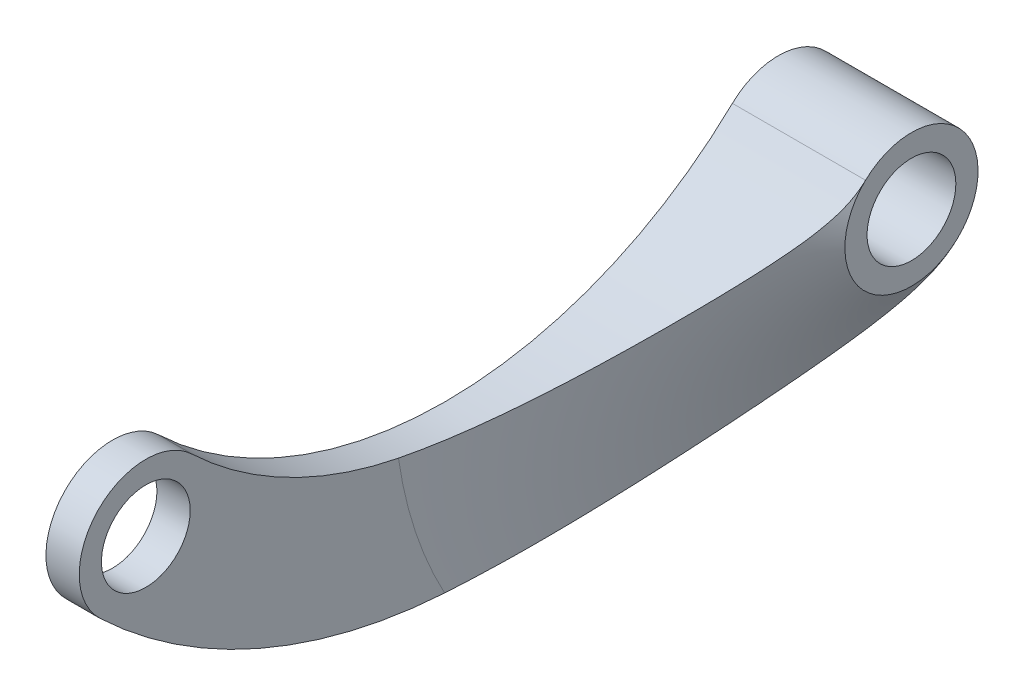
ISO-10303-21;
HEADER;
FILE_DESCRIPTION(('STEP AP214'),'2;1');
FILE_NAME('part.step','',(''),(''),'','','');
FILE_SCHEMA(('AUTOMOTIVE_DESIGN { 1 0 10303 214 1 1 1 1 }'));
ENDSEC;
DATA;
#1=APPLICATION_CONTEXT('core data for automotive mechanical design processes');
#2=APPLICATION_PROTOCOL_DEFINITION('international standard','automotive_design',2000,#1);
#3=PRODUCT_CONTEXT('',#1,'mechanical');
#4=PRODUCT('Part','Part','',(#3));
#5=PRODUCT_RELATED_PRODUCT_CATEGORY('part','',(#4));
#6=PRODUCT_DEFINITION_FORMATION('','',#4);
#7=PRODUCT_DEFINITION_CONTEXT('part definition',#1,'design');
#8=PRODUCT_DEFINITION('design','',#6,#7);
#9=PRODUCT_DEFINITION_SHAPE('','',#8);
#10=(LENGTH_UNIT() NAMED_UNIT(*) SI_UNIT(.MILLI.,.METRE.));
#11=(NAMED_UNIT(*) PLANE_ANGLE_UNIT() SI_UNIT($,.RADIAN.));
#12=(NAMED_UNIT(*) SI_UNIT($,.STERADIAN.) SOLID_ANGLE_UNIT());
#13=UNCERTAINTY_MEASURE_WITH_UNIT(LENGTH_MEASURE(1.E-05),#10,'distance_accuracy_value','');
#14=(GEOMETRIC_REPRESENTATION_CONTEXT(3) GLOBAL_UNCERTAINTY_ASSIGNED_CONTEXT((#13)) GLOBAL_UNIT_ASSIGNED_CONTEXT((#10,
#11,#12)) REPRESENTATION_CONTEXT('',''));
#15=CARTESIAN_POINT('',(0.,0.,0.));
#16=DIRECTION('',(0.,0.,1.));
#17=DIRECTION('',(1.,0.,0.));
#18=AXIS2_PLACEMENT_3D('',#15,#16,#17);
#19=CARTESIAN_POINT('',(-5.,78.75,75.0000000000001));
#20=DIRECTION('',(1.,0.,0.));
#21=DIRECTION('',(0.,0.,-1.));
#22=AXIS2_PLACEMENT_3D('',#19,#20,#21);
#23=PLANE('',#22);
#24=CARTESIAN_POINT('',(-5.,0.,150.));
#25=DIRECTION('',(1.,0.,0.));
#26=DIRECTION('',(0.,0.,-1.));
#27=AXIS2_PLACEMENT_3D('',#24,#25,#26);
#28=CIRCLE('',#27,20.0000000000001);
#29=CARTESIAN_POINT('',(-5.,0.,130.));
#30=VERTEX_POINT('',#29);
#31=EDGE_CURVE('E100',#30,#30,#28,.T.);
#32=ORIENTED_EDGE('',*,*,#31,.F.);
#33=EDGE_LOOP('',(#32));
#34=FACE_BOUND('',#33,.T.);
#35=CARTESIAN_POINT('',(-5.,157.5,0.));
#36=DIRECTION('',(1.,0.,0.));
#37=DIRECTION('',(0.,0.,-1.));
#38=AXIS2_PLACEMENT_3D('',#35,#36,#37);
#39=CIRCLE('',#38,247.5);
#40=CARTESIAN_POINT('',(-5.,-21.7241379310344,170.689655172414));
#41=VERTEX_POINT('',#40);
#42=CARTESIAN_POINT('',(-5.,-89.5231469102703,15.3562655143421));
#43=VERTEX_POINT('',#42);
#44=EDGE_CURVE('E93',#41,#43,#39,.T.);
#45=ORIENTED_EDGE('',*,*,#44,.T.);
#46=CARTESIAN_POINT('',(-5.,0.,-150.));
#47=DIRECTION('',(1.,0.,0.));
#48=DIRECTION('',(0.,0.,-1.));
#49=AXIS2_PLACEMENT_3D('',#46,#47,#48);
#50=CIRCLE('',#49,188.034806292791);
#51=CARTESIAN_POINT('',(-5.,-26.4799875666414,36.1609482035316));
#52=VERTEX_POINT('',#51);
#53=EDGE_CURVE('E111',#43,#52,#50,.F.);
#54=ORIENTED_EDGE('',*,*,#53,.T.);
#55=CARTESIAN_POINT('',(-5.,157.5,0.));
#56=DIRECTION('',(-1.,0.,0.));
#57=DIRECTION('',(0.,0.,-1.));
#58=AXIS2_PLACEMENT_3D('',#55,#56,#57);
#59=CIRCLE('',#58,187.5);
#60=CARTESIAN_POINT('',(-5.,21.7241379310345,129.310344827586));
#61=VERTEX_POINT('',#60);
#62=EDGE_CURVE('E96',#52,#61,#59,.T.);
#63=ORIENTED_EDGE('',*,*,#62,.T.);
#64=CARTESIAN_POINT('',(-5.,0.,150.));
#65=DIRECTION('',(1.,0.,0.));
#66=DIRECTION('',(0.,0.,-1.));
#67=AXIS2_PLACEMENT_3D('',#64,#65,#66);
#68=CIRCLE('',#67,30.);
#69=EDGE_CURVE('E90',#61,#41,#68,.T.);
#70=ORIENTED_EDGE('',*,*,#69,.T.);
#71=EDGE_LOOP('',(#45,#54,#63,#70));
#72=FACE_BOUND('',#71,.T.);
#73=ADVANCED_FACE('F38',(#34,#72),#23,.T.);
#74=CARTESIAN_POINT('',(20.,0.,150.));
#75=DIRECTION('',(-1.,0.,0.));
#76=DIRECTION('',(0.,0.,1.));
#77=AXIS2_PLACEMENT_3D('',#74,#75,#76);
#78=CYLINDRICAL_SURFACE('',#77,30.);
#79=ORIENTED_EDGE('',*,*,#69,.F.);
#80=DIRECTION('',(-1.,0.,0.));
#81=VECTOR('',#80,1.);
#82=CARTESIAN_POINT('',(20.,21.7241379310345,129.310344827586));
#83=LINE('',#82,#81);
#84=CARTESIAN_POINT('',(-20.,21.7241379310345,129.310344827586));
#85=VERTEX_POINT('',#84);
#86=EDGE_CURVE('E178',#61,#85,#83,.T.);
#87=ORIENTED_EDGE('',*,*,#86,.T.);
#88=CARTESIAN_POINT('',(-20.,0.,150.));
#89=DIRECTION('',(1.,0.,0.));
#90=DIRECTION('',(0.,0.,-1.));
#91=AXIS2_PLACEMENT_3D('',#88,#89,#90);
#92=CIRCLE('',#91,30.);
#93=CARTESIAN_POINT('',(-20.,-21.7241379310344,170.689655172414));
#94=VERTEX_POINT('',#93);
#95=EDGE_CURVE('E110',#85,#94,#92,.T.);
#96=ORIENTED_EDGE('',*,*,#95,.T.);
#97=DIRECTION('',(-1.,0.,0.));
#98=VECTOR('',#97,1.);
#99=CARTESIAN_POINT('',(20.,-21.7241379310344,170.689655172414));
#100=LINE('',#99,#98);
#101=EDGE_CURVE('E103',#41,#94,#100,.T.);
#102=ORIENTED_EDGE('',*,*,#101,.F.);
#103=EDGE_LOOP('',(#79,#87,#96,#102));
#104=FACE_BOUND('',#103,.T.);
#105=ADVANCED_FACE('F108',(#104),#78,.T.);
#106=CARTESIAN_POINT('',(20.,157.5,0.));
#107=DIRECTION('',(-1.,0.,0.));
#108=DIRECTION('',(0.,0.,1.));
#109=AXIS2_PLACEMENT_3D('',#106,#107,#108);
#110=CYLINDRICAL_SURFACE('',#109,247.5);
#111=ORIENTED_EDGE('',*,*,#44,.F.);
#112=ORIENTED_EDGE('',*,*,#101,.T.);
#113=CARTESIAN_POINT('',(-20.,157.5,0.));
#114=DIRECTION('',(1.,0.,0.));
#115=DIRECTION('',(0.,0.,-1.));
#116=AXIS2_PLACEMENT_3D('',#113,#114,#115);
#117=CIRCLE('',#116,247.5);
#118=CARTESIAN_POINT('',(-20.,-21.7241379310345,-170.689655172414));
#119=VERTEX_POINT('',#118);
#120=EDGE_CURVE('E171',#94,#119,#117,.T.);
#121=ORIENTED_EDGE('',*,*,#120,.T.);
#122=DIRECTION('',(-1.,0.,0.));
#123=VECTOR('',#122,1.);
#124=CARTESIAN_POINT('',(20.,-21.7241379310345,-170.689655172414));
#125=LINE('',#124,#123);
#126=CARTESIAN_POINT('',(40.,-21.7241379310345,-170.689655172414));
#127=VERTEX_POINT('',#126);
#128=EDGE_CURVE('E58',#127,#119,#125,.T.);
#129=ORIENTED_EDGE('',*,*,#128,.F.);
#130=CARTESIAN_POINT('',(40.,-21.7241379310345,-170.689655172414));
#131=CARTESIAN_POINT('',(40.0000175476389,-22.0348676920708,-170.363390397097));
#132=CARTESIAN_POINT('',(39.9944724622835,-22.3447024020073,-170.036278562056));
#133=CARTESIAN_POINT('',(39.9723857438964,-22.9623878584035,-169.380575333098));
#134=CARTESIAN_POINT('',(39.9558444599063,-23.2702386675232,-169.051983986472));
#135=CARTESIAN_POINT('',(39.9119036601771,-23.8836480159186,-168.393659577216));
#136=CARTESIAN_POINT('',(39.8845088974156,-24.1892074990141,-168.063927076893));
#137=CARTESIAN_POINT('',(39.8191145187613,-24.79800016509,-167.403377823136));
#138=CARTESIAN_POINT('',(39.7811148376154,-25.1012333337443,-167.072561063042));
#139=CARTESIAN_POINT('',(39.6520724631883,-26.0044301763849,-166.081817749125));
#140=CARTESIAN_POINT('',(39.5457748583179,-26.6007642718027,-165.42051416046));
#141=CARTESIAN_POINT('',(39.2957261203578,-27.7827912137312,-164.095477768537));
#142=CARTESIAN_POINT('',(39.1519710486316,-28.3684829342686,-163.431744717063));
#143=CARTESIAN_POINT('',(38.8319290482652,-29.5256652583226,-162.10620125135));
#144=CARTESIAN_POINT('',(38.6558185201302,-30.0972146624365,-161.444399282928));
#145=CARTESIAN_POINT('',(38.2748152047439,-31.2291869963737,-160.119652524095));
#146=CARTESIAN_POINT('',(38.069922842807,-31.789610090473,-159.456707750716));
#147=CARTESIAN_POINT('',(37.6352324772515,-32.9002798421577,-158.128851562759));
#148=CARTESIAN_POINT('',(37.4054006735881,-33.4505114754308,-157.463938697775));
#149=CARTESIAN_POINT('',(37.0450924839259,-34.2678668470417,-156.465715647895));
#150=CARTESIAN_POINT('',(36.9223970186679,-34.5389852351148,-156.132834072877));
#151=CARTESIAN_POINT('',(36.6722647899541,-35.0786215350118,-155.466743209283));
#152=CARTESIAN_POINT('',(36.5448280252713,-35.3471394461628,-155.133533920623));
#153=CARTESIAN_POINT('',(36.16224095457,-36.1361290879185,-154.14926348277));
#154=CARTESIAN_POINT('',(35.9010364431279,-36.6530283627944,-153.497686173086));
#155=CARTESIAN_POINT('',(35.3651315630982,-37.6775866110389,-152.192798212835));
#156=CARTESIAN_POINT('',(35.0904305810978,-38.1852451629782,-151.539487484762));
#157=CARTESIAN_POINT('',(34.5300303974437,-39.1918345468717,-150.230668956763));
#158=CARTESIAN_POINT('',(34.2443292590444,-39.6907638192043,-149.575160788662));
#159=CARTESIAN_POINT('',(33.6641788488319,-40.6802088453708,-148.261697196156));
#160=CARTESIAN_POINT('',(33.3697296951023,-41.1707247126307,-147.603741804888));
#161=CARTESIAN_POINT('',(32.7737636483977,-42.1440645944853,-146.284550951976));
#162=CARTESIAN_POINT('',(32.4722419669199,-42.6268830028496,-145.62331352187));
#163=CARTESIAN_POINT('',(31.8639564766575,-43.5848085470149,-144.297673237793));
#164=CARTESIAN_POINT('',(31.5571926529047,-44.0599156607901,-143.633270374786));
#165=CARTESIAN_POINT('',(30.939846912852,-45.002661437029,-142.301046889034));
#166=CARTESIAN_POINT('',(30.629265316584,-45.4703007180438,-141.633226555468));
#167=CARTESIAN_POINT('',(30.0054596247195,-46.3983888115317,-140.293837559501));
#168=CARTESIAN_POINT('',(29.6922355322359,-46.8588376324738,-139.622268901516));
#169=CARTESIAN_POINT('',(29.0637649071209,-47.7733458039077,-138.274248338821));
#170=CARTESIAN_POINT('',(28.7485162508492,-48.2273959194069,-137.597791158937));
#171=CARTESIAN_POINT('',(28.1172974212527,-49.1286429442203,-136.240659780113));
#172=CARTESIAN_POINT('',(27.8013272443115,-49.5758398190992,-135.559985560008));
#173=CARTESIAN_POINT('',(26.8535212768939,-50.9073552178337,-133.511340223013));
#174=CARTESIAN_POINT('',(26.2217914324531,-51.7815965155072,-132.136749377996));
#175=CARTESIAN_POINT('',(24.9639362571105,-53.5035222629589,-129.36930969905));
#176=CARTESIAN_POINT('',(24.3378089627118,-54.3512162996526,-127.976467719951));
#177=CARTESIAN_POINT('',(23.0947520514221,-56.0206529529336,-125.171261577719));
#178=CARTESIAN_POINT('',(22.4778223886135,-56.8423956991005,-123.758897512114));
#179=CARTESIAN_POINT('',(21.2511458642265,-58.466550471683,-120.902523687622));
#180=CARTESIAN_POINT('',(20.6414991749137,-59.2687491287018,-119.458349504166));
#181=CARTESIAN_POINT('',(19.4369927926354,-60.846550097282,-116.54943930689));
#182=CARTESIAN_POINT('',(18.8421331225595,-61.6221523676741,-115.084703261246));
#183=CARTESIAN_POINT('',(17.6690533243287,-63.1464601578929,-112.134502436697));
#184=CARTESIAN_POINT('',(17.090834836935,-63.8951630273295,-110.649035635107));
#185=CARTESIAN_POINT('',(15.95263025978,-65.365104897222,-107.657662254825));
#186=CARTESIAN_POINT('',(15.3926441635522,-66.0863439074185,-106.151755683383));
#187=CARTESIAN_POINT('',(14.2924110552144,-67.5004476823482,-103.120532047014));
#188=CARTESIAN_POINT('',(13.7521545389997,-68.1933261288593,-101.595224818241));
#189=CARTESIAN_POINT('',(12.6920990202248,-69.5504625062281,-98.524893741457));
#190=CARTESIAN_POINT('',(12.172300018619,-70.2147204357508,-96.9798698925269));
#191=CARTESIAN_POINT('',(11.1539941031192,-71.5139488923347,-93.870654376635));
#192=CARTESIAN_POINT('',(10.6554865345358,-72.1489203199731,-92.3064633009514));
#193=CARTESIAN_POINT('',(9.68041065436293,-73.3889314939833,-89.1594757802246));
#194=CARTESIAN_POINT('',(9.20384295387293,-73.9939704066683,-87.5766788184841));
#195=CARTESIAN_POINT('',(7.80245669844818,-75.7700733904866,-82.7827352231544));
#196=CARTESIAN_POINT('',(6.91187134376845,-76.8945769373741,-79.5440673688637));
#197=CARTESIAN_POINT('',(5.22510584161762,-79.0142585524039,-73.0005774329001));
#198=CARTESIAN_POINT('',(4.42892677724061,-80.0094351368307,-69.6957545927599));
#199=CARTESIAN_POINT('',(2.93269105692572,-81.8657202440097,-63.0260830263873));
#200=CARTESIAN_POINT('',(2.23266183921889,-82.7267905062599,-59.6612174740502));
#201=CARTESIAN_POINT('',(0.930073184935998,-84.3099249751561,-52.8803523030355));
#202=CARTESIAN_POINT('',(0.327512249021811,-85.0319913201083,-49.4643534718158));
#203=CARTESIAN_POINT('',(-0.779503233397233,-86.3327757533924,-42.59168030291));
#204=CARTESIAN_POINT('',(-1.28401860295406,-86.9115827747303,-39.1350326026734));
#205=CARTESIAN_POINT('',(-2.19572625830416,-87.9231830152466,-32.1874899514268));
#206=CARTESIAN_POINT('',(-2.60291327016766,-88.3559683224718,-28.6965931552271));
#207=CARTESIAN_POINT('',(-3.32047601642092,-89.0726822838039,-21.6921364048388));
#208=CARTESIAN_POINT('',(-3.63091747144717,-89.356712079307,-18.1785934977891));
#209=CARTESIAN_POINT('',(-4.15653083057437,-89.7744983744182,-11.1360249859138));
#210=CARTESIAN_POINT('',(-4.37172211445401,-89.9082854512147,-7.60700267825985));
#211=CARTESIAN_POINT('',(-4.61737526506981,-89.9931524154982,-2.45360335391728));
#212=CARTESIAN_POINT('',(-4.68479332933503,-90.003919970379,-0.831691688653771));
#213=CARTESIAN_POINT('',(-4.80007494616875,-89.9935563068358,2.41234965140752));
#214=CARTESIAN_POINT('',(-4.84794347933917,-89.9724332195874,4.03447916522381));
#215=CARTESIAN_POINT('',(-4.92422003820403,-89.8983823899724,7.27374263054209));
#216=CARTESIAN_POINT('',(-4.95268417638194,-89.8455471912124,8.89087740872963));
#217=CARTESIAN_POINT('',(-4.9905773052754,-89.7081476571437,12.124424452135));
#218=CARTESIAN_POINT('',(-5.00000156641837,-89.6235754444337,13.7408364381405));
#219=CARTESIAN_POINT('',(-4.99999999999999,-89.5231469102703,15.3562655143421));
#220=B_SPLINE_CURVE_WITH_KNOTS('',3,(#130,#131,#132,#133,#134,#135,#136,#137,#138,#139,#140,
#141,#142,#143,#144,#145,#146,#147,#148,#149,#150,#151,#152,#153,#154,#155,#156,#157,#158,#159,
#160,#161,#162,#163,#164,#165,#166,#167,#168,#169,#170,#171,#172,#173,#174,#175,#176,#177,#178,
#179,#180,#181,#182,#183,#184,#185,#186,#187,#188,#189,#190,#191,#192,#193,#194,#195,#196,#197,
#198,#199,#200,#201,#202,#203,#204,#205,#206,#207,#208,#209,#210,#211,#212,#213,#214,#215,#216,
#217,#218,#219),.UNSPECIFIED.,.F.,.F.,(4,2,2,2,2,2,2,2,2,2,2,2,2,2,2,2,2,2,2,2,2,2,2,2,2,2,2,2,
2,2,2,2,2,2,2,2,2,2,2,2,2,2,2,2,4),(0.,1.3516288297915,2.70321475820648,4.05420945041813,
5.40521245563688,8.09457075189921,10.7842119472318,13.4596024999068,16.1349535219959,
18.8139767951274,20.1534744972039,21.492972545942,24.1080530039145,26.7232524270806,
29.3389144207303,31.9545411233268,34.5719930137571,37.189452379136,39.8066938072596,
42.4239321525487,45.0446247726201,47.6653305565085,52.9067535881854,58.1462614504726,
63.3857431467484,68.6681252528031,73.9505155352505,79.2334248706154,84.5163323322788,
89.7966604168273,95.0769887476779,100.357154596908,105.637467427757,116.25929934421,
126.881253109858,137.506231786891,148.131047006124,158.749249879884,169.36802799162,
179.979576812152,190.588965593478,195.458671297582,200.32713557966,205.181461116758,
210.036992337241),.UNSPECIFIED.);
#221=EDGE_CURVE('E11',#127,#43,#220,.T.);
#222=ORIENTED_EDGE('',*,*,#221,.T.);
#223=EDGE_LOOP('',(#111,#112,#121,#129,#222));
#224=FACE_BOUND('',#223,.T.);
#225=ADVANCED_FACE('F102',(#224),#110,.T.);
#226=CARTESIAN_POINT('',(20.,0.,-150.));
#227=DIRECTION('',(-1.,0.,0.));
#228=DIRECTION('',(0.,0.,1.));
#229=AXIS2_PLACEMENT_3D('',#226,#227,#228);
#230=CYLINDRICAL_SURFACE('',#229,30.);
#231=DIRECTION('',(-1.,0.,0.));
#232=VECTOR('',#231,1.);
#233=CARTESIAN_POINT('',(20.,21.7241379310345,-129.310344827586));
#234=LINE('',#233,#232);
#235=CARTESIAN_POINT('',(40.,21.7241379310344,-129.310344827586));
#236=VERTEX_POINT('',#235);
#237=CARTESIAN_POINT('',(-20.,21.7241379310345,-129.310344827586));
#238=VERTEX_POINT('',#237);
#239=EDGE_CURVE('E65',#236,#238,#234,.T.);
#240=ORIENTED_EDGE('',*,*,#239,.F.);
#241=CARTESIAN_POINT('',(40.,0.,-150.));
#242=DIRECTION('',(1.,0.,0.));
#243=DIRECTION('',(0.,0.,-1.));
#244=AXIS2_PLACEMENT_3D('',#241,#242,#243);
#245=CIRCLE('',#244,29.9999999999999);
#246=EDGE_CURVE('E161',#127,#236,#245,.T.);
#247=ORIENTED_EDGE('',*,*,#246,.F.);
#248=ORIENTED_EDGE('',*,*,#128,.T.);
#249=CARTESIAN_POINT('',(-20.,0.,-150.));
#250=DIRECTION('',(1.,0.,0.));
#251=DIRECTION('',(0.,0.,-1.));
#252=AXIS2_PLACEMENT_3D('',#249,#250,#251);
#253=CIRCLE('',#252,30.);
#254=EDGE_CURVE('E173',#119,#238,#253,.T.);
#255=ORIENTED_EDGE('',*,*,#254,.T.);
#256=EDGE_LOOP('',(#240,#247,#248,#255));
#257=FACE_BOUND('',#256,.T.);
#258=ADVANCED_FACE('F127',(#257),#230,.T.);
#259=CARTESIAN_POINT('',(20.,157.5,0.));
#260=DIRECTION('',(-1.,0.,0.));
#261=DIRECTION('',(0.,0.,1.));
#262=AXIS2_PLACEMENT_3D('',#259,#260,#261);
#263=CYLINDRICAL_SURFACE('',#262,187.5);
#264=ORIENTED_EDGE('',*,*,#62,.F.);
#265=CARTESIAN_POINT('',(-5.,-26.4799875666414,36.1609482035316));
#266=CARTESIAN_POINT('',(-5.00001005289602,-26.8632913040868,34.2109110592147));
#267=CARTESIAN_POINT('',(-4.98239169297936,-27.2155423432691,32.2547583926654));
#268=CARTESIAN_POINT('',(-4.91118067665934,-27.8576120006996,28.3328676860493));
#269=CARTESIAN_POINT('',(-4.85758767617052,-28.1474300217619,26.3671295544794));
#270=CARTESIAN_POINT('',(-4.71371506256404,-28.6642806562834,22.428892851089));
#271=CARTESIAN_POINT('',(-4.62343809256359,-28.8913177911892,20.45639477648));
#272=CARTESIAN_POINT('',(-4.40555929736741,-29.2824894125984,16.5072308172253));
#273=CARTESIAN_POINT('',(-4.27795757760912,-29.44662407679,14.5305649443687));
#274=CARTESIAN_POINT('',(-3.98486721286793,-29.7119821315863,10.5759561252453));
#275=CARTESIAN_POINT('',(-3.81938119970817,-29.8132098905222,8.59801327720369));
#276=CARTESIAN_POINT('',(-3.45000910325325,-29.9529397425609,4.64332688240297));
#277=CARTESIAN_POINT('',(-3.24611973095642,-29.9914364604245,2.66658345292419));
#278=CARTESIAN_POINT('',(-2.79953099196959,-30.0060105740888,-1.28285022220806));
#279=CARTESIAN_POINT('',(-2.55682966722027,-29.9820848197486,-3.25554025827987));
#280=CARTESIAN_POINT('',(-2.03233610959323,-29.8723015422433,-7.19381499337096));
#281=CARTESIAN_POINT('',(-1.7505469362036,-29.786448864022,-9.15940023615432));
#282=CARTESIAN_POINT('',(-1.10470233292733,-29.5368669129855,-13.3602232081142));
#283=CARTESIAN_POINT('',(-0.734646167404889,-29.363786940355,-15.5939910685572));
#284=CARTESIAN_POINT('',(0.056925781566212,-28.9388659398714,-20.0448831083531));
#285=CARTESIAN_POINT('',(0.478442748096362,-28.6870231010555,-22.2620069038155));
#286=CARTESIAN_POINT('',(1.37291197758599,-28.1060306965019,-26.6759655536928));
#287=CARTESIAN_POINT('',(1.84587112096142,-27.7768707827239,-28.8727976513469));
#288=CARTESIAN_POINT('',(2.8428593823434,-27.0430040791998,-33.2420971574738));
#289=CARTESIAN_POINT('',(3.36688828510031,-26.6382976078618,-35.4145646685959));
#290=CARTESIAN_POINT('',(4.46646717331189,-25.7544723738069,-39.7356354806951));
#291=CARTESIAN_POINT('',(5.04211195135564,-25.2752154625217,-41.8841863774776));
#292=CARTESIAN_POINT('',(6.24319296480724,-24.2450099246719,-46.1499279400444));
#293=CARTESIAN_POINT('',(6.86862895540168,-23.6940616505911,-48.2671187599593));
#294=CARTESIAN_POINT('',(8.16784914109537,-22.5229739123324,-52.4664566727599));
#295=CARTESIAN_POINT('',(8.84161845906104,-21.9028557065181,-54.5486143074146));
#296=CARTESIAN_POINT('',(10.2360574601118,-20.5956679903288,-58.6759658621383));
#297=CARTESIAN_POINT('',(10.9567283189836,-19.9085968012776,-60.7211588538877));
#298=CARTESIAN_POINT('',(12.1791115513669,-18.7251929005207,-64.0535334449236));
#299=CARTESIAN_POINT('',(12.667802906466,-18.2476638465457,-65.3522325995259));
#300=CARTESIAN_POINT('',(13.6630617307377,-17.2663841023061,-67.9328085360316));
#301=CARTESIAN_POINT('',(14.1696294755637,-16.7626330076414,-69.2146850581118));
#302=CARTESIAN_POINT('',(15.199816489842,-15.7294863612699,-71.7612950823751));
#303=CARTESIAN_POINT('',(15.723437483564,-15.2000882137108,-73.0260268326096));
#304=CARTESIAN_POINT('',(16.7866508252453,-14.1162686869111,-75.5379202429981));
#305=CARTESIAN_POINT('',(17.3262431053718,-13.5618474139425,-76.7850819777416));
#306=CARTESIAN_POINT('',(18.4212960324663,-12.4273204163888,-79.2642289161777));
#307=CARTESIAN_POINT('',(18.9767871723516,-11.8471639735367,-80.4961774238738));
#308=CARTESIAN_POINT('',(20.1010669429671,-10.6626617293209,-82.9422438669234));
#309=CARTESIAN_POINT('',(20.6698556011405,-10.0583158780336,-84.1563617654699));
#310=CARTESIAN_POINT('',(21.8187671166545,-8.82587738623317,-86.566646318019));
#311=CARTESIAN_POINT('',(22.3988874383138,-8.19779002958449,-87.7628168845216));
#312=CARTESIAN_POINT('',(23.5683162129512,-6.91788572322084,-90.1378312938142));
#313=CARTESIAN_POINT('',(24.1576246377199,-6.26606884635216,-91.3166751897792));
#314=CARTESIAN_POINT('',(25.3342606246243,-4.94795862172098,-93.6411811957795));
#315=CARTESIAN_POINT('',(25.921499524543,-4.28199770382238,-94.7870768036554));
#316=CARTESIAN_POINT('',(27.0986943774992,-2.92657386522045,-97.0634806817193));
#317=CARTESIAN_POINT('',(27.6886503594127,-2.23711069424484,-98.1939887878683));
#318=CARTESIAN_POINT('',(28.8673307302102,-0.833399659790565,-100.44173419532));
#319=CARTESIAN_POINT('',(29.456053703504,-0.119131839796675,-101.558959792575));
#320=CARTESIAN_POINT('',(30.3334040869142,0.971322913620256,-103.22530534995));
#321=CARTESIAN_POINT('',(30.6248969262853,1.33798123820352,-103.779168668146));
#322=CARTESIAN_POINT('',(31.2050473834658,2.07786063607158,-104.883986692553));
#323=CARTESIAN_POINT('',(31.4937050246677,2.45108165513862,-105.434941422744));
#324=CARTESIAN_POINT('',(32.0659136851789,3.20270795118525,-106.531853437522));
#325=CARTESIAN_POINT('',(32.3494813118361,3.5810840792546,-107.07782202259));
#326=CARTESIAN_POINT('',(32.9115751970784,4.34486038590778,-108.167443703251));
#327=CARTESIAN_POINT('',(33.190101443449,4.73026058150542,-108.711096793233));
#328=CARTESIAN_POINT('',(33.7407665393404,5.50847205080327,-109.79650012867));
#329=CARTESIAN_POINT('',(34.0129042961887,5.9012845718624,-110.338250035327));
#330=CARTESIAN_POINT('',(34.5491225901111,6.69461996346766,-111.420093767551));
#331=CARTESIAN_POINT('',(34.8132031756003,7.09514278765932,-111.960187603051));
#332=CARTESIAN_POINT('',(35.3310333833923,7.90368657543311,-113.038251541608));
#333=CARTESIAN_POINT('',(35.5847981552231,8.31169516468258,-113.576223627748));
#334=CARTESIAN_POINT('',(36.0802654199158,9.13624397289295,-114.651231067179));
#335=CARTESIAN_POINT('',(36.3219675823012,9.5527844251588,-115.188266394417));
#336=CARTESIAN_POINT('',(36.790728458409,10.3946624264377,-116.261492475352));
#337=CARTESIAN_POINT('',(37.0177925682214,10.819996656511,-116.797683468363));
#338=CARTESIAN_POINT('',(37.4545458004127,11.6799952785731,-117.869624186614));
#339=CARTESIAN_POINT('',(37.6642365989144,12.1146587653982,-118.405373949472));
#340=CARTESIAN_POINT('',(37.9443341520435,12.7318997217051,-119.157566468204));
#341=CARTESIAN_POINT('',(38.0233173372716,12.9104380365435,-119.374149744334));
#342=CARTESIAN_POINT('',(38.1777097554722,13.2691147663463,-119.807265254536));
#343=CARTESIAN_POINT('',(38.2531189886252,13.4492531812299,-120.023797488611));
#344=CARTESIAN_POINT('',(38.473663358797,13.9921217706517,-120.673349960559));
#345=CARTESIAN_POINT('',(38.61310401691,14.3572808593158,-121.106296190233));
#346=CARTESIAN_POINT('',(38.8748755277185,15.0938836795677,-121.971597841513));
#347=CARTESIAN_POINT('',(38.9972157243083,15.4653238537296,-122.403953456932));
#348=CARTESIAN_POINT('',(39.2230364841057,16.2146071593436,-123.268060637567));
#349=CARTESIAN_POINT('',(39.3265172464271,16.5924502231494,-123.699812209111));
#350=CARTESIAN_POINT('',(39.5136000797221,17.3573168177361,-124.56570407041));
#351=CARTESIAN_POINT('',(39.5970399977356,17.7443890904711,-124.999836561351));
#352=CARTESIAN_POINT('',(39.7413995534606,18.5244335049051,-125.866523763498));
#353=CARTESIAN_POINT('',(39.8023201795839,18.9174053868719,-126.299078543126));
#354=CARTESIAN_POINT('',(39.9005330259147,19.7099030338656,-127.163217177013));
#355=CARTESIAN_POINT('',(39.9377565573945,20.1094444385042,-127.594794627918));
#356=CARTESIAN_POINT('',(39.9750606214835,20.7123488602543,-128.239912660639));
#357=CARTESIAN_POINT('',(39.9844067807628,20.9139429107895,-128.454605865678));
#358=CARTESIAN_POINT('',(39.9968786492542,21.3182339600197,-128.883138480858));
#359=CARTESIAN_POINT('',(40.000004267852,21.5209309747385,-129.096977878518));
#360=CARTESIAN_POINT('',(40.,21.7241379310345,-129.310344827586));
#361=B_SPLINE_CURVE_WITH_KNOTS('',3,(#265,#266,#267,#268,#269,#270,#271,#272,#273,#274,#275,
#276,#277,#278,#279,#280,#281,#282,#283,#284,#285,#286,#287,#288,#289,#290,#291,#292,#293,#294,
#295,#296,#297,#298,#299,#300,#301,#302,#303,#304,#305,#306,#307,#308,#309,#310,#311,#312,#313,
#314,#315,#316,#317,#318,#319,#320,#321,#322,#323,#324,#325,#326,#327,#328,#329,#330,#331,#332,
#333,#334,#335,#336,#337,#338,#339,#340,#341,#342,#343,#344,#345,#346,#347,#348,#349,#350,#351,
#352,#353,#354,#355,#356,#357,#358,#359,#360),.UNSPECIFIED.,.F.,.F.,(4,2,2,2,2,2,2,2,2,2,2,2,2,
2,2,2,2,2,2,2,2,2,2,2,2,2,2,2,2,2,2,2,2,2,2,2,2,2,2,2,2,2,2,2,2,2,2,4),(0.,5.96174261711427,
11.9235422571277,17.8849124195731,23.8462657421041,29.8072050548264,35.7686551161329,
41.7304060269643,47.6916905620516,54.50208214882,61.3126303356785,68.1240905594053,
74.9355220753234,81.7597295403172,88.5839034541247,95.4059858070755,102.228239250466,
106.630254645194,111.032337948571,115.434867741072,119.837378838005,124.248989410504,
128.660609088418,133.071252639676,137.481882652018,141.830494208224,146.179152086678,
150.531393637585,152.707490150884,154.883568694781,157.050301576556,159.217039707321,
161.384145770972,163.551238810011,165.715024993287,167.87887042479,170.041913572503,
172.204747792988,173.079484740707,173.954221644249,175.703815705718,177.452449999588,
179.201065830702,180.963386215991,182.72562924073,184.492957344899,185.376857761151,
186.260771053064),.UNSPECIFIED.);
#362=EDGE_CURVE('E52',#52,#236,#361,.T.);
#363=ORIENTED_EDGE('',*,*,#362,.T.);
#364=ORIENTED_EDGE('',*,*,#239,.T.);
#365=CARTESIAN_POINT('',(-20.,157.5,0.));
#366=DIRECTION('',(-1.,0.,0.));
#367=DIRECTION('',(0.,0.,-1.));
#368=AXIS2_PLACEMENT_3D('',#365,#366,#367);
#369=CIRCLE('',#368,187.5);
#370=EDGE_CURVE('E175',#238,#85,#369,.T.);
#371=ORIENTED_EDGE('',*,*,#370,.T.);
#372=ORIENTED_EDGE('',*,*,#86,.F.);
#373=EDGE_LOOP('',(#264,#363,#364,#371,#372));
#374=FACE_BOUND('',#373,.T.);
#375=ADVANCED_FACE('F121',(#374),#263,.F.);
#376=CARTESIAN_POINT('',(20.,0.,150.));
#377=DIRECTION('',(-1.,0.,0.));
#378=DIRECTION('',(0.,0.,1.));
#379=AXIS2_PLACEMENT_3D('',#376,#377,#378);
#380=CYLINDRICAL_SURFACE('',#379,20.0000000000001);
#381=CARTESIAN_POINT('',(-20.,0.,150.));
#382=DIRECTION('',(1.,0.,0.));
#383=DIRECTION('',(0.,0.,-1.));
#384=AXIS2_PLACEMENT_3D('',#381,#382,#383);
#385=CIRCLE('',#384,20.0000000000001);
#386=CARTESIAN_POINT('',(-20.,0.,130.));
#387=VERTEX_POINT('',#386);
#388=EDGE_CURVE('E156',#387,#387,#385,.T.);
#389=ORIENTED_EDGE('',*,*,#388,.F.);
#390=EDGE_LOOP('',(#389));
#391=FACE_BOUND('',#390,.T.);
#392=ORIENTED_EDGE('',*,*,#31,.T.);
#393=EDGE_LOOP('',(#392));
#394=FACE_BOUND('',#393,.T.);
#395=ADVANCED_FACE('F126',(#391,#394),#380,.F.);
#396=CARTESIAN_POINT('',(20.,0.,-150.));
#397=DIRECTION('',(-1.,0.,0.));
#398=DIRECTION('',(0.,0.,1.));
#399=AXIS2_PLACEMENT_3D('',#396,#397,#398);
#400=CYLINDRICAL_SURFACE('',#399,20.);
#401=CARTESIAN_POINT('',(-20.,0.,-150.));
#402=DIRECTION('',(1.,0.,0.));
#403=DIRECTION('',(0.,0.,-1.));
#404=AXIS2_PLACEMENT_3D('',#401,#402,#403);
#405=CIRCLE('',#404,20.);
#406=CARTESIAN_POINT('',(-20.,0.,-170.));
#407=VERTEX_POINT('',#406);
#408=EDGE_CURVE('E166',#407,#407,#405,.T.);
#409=ORIENTED_EDGE('',*,*,#408,.F.);
#410=EDGE_LOOP('',(#409));
#411=FACE_BOUND('',#410,.T.);
#412=CARTESIAN_POINT('',(40.,0.,-150.));
#413=DIRECTION('',(1.,0.,0.));
#414=DIRECTION('',(0.,0.,-1.));
#415=AXIS2_PLACEMENT_3D('',#412,#413,#414);
#416=CIRCLE('',#415,20.);
#417=CARTESIAN_POINT('',(40.,0.,-170.));
#418=VERTEX_POINT('',#417);
#419=EDGE_CURVE('E190',#418,#418,#416,.T.);
#420=ORIENTED_EDGE('',*,*,#419,.T.);
#421=EDGE_LOOP('',(#420));
#422=FACE_BOUND('',#421,.T.);
#423=ADVANCED_FACE('F146',(#411,#422),#400,.F.);
#424=CARTESIAN_POINT('',(-20.,78.75,75.0000000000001));
#425=DIRECTION('',(1.,0.,0.));
#426=DIRECTION('',(0.,0.,-1.));
#427=AXIS2_PLACEMENT_3D('',#424,#425,#426);
#428=PLANE('',#427);
#429=ORIENTED_EDGE('',*,*,#254,.F.);
#430=ORIENTED_EDGE('',*,*,#120,.F.);
#431=ORIENTED_EDGE('',*,*,#95,.F.);
#432=ORIENTED_EDGE('',*,*,#370,.F.);
#433=EDGE_LOOP('',(#429,#430,#431,#432));
#434=FACE_BOUND('',#433,.T.);
#435=ORIENTED_EDGE('',*,*,#408,.T.);
#436=EDGE_LOOP('',(#435));
#437=FACE_BOUND('',#436,.T.);
#438=ORIENTED_EDGE('',*,*,#388,.T.);
#439=EDGE_LOOP('',(#438));
#440=FACE_BOUND('',#439,.T.);
#441=ADVANCED_FACE('F129',(#434,#437,#440),#428,.F.);
#442=CARTESIAN_POINT('',(40.,0.,-150.));
#443=DIRECTION('',(1.,0.,0.));
#444=DIRECTION('',(0.,0.,-1.));
#445=AXIS2_PLACEMENT_3D('',#442,#443,#444);
#446=PLANE('',#445);
#447=EDGE_CURVE('E158',#236,#127,#245,.T.);
#448=ORIENTED_EDGE('',*,*,#447,.T.);
#449=ORIENTED_EDGE('',*,*,#246,.T.);
#450=EDGE_LOOP('',(#448,#449));
#451=FACE_BOUND('',#450,.T.);
#452=ORIENTED_EDGE('',*,*,#419,.F.);
#453=EDGE_LOOP('',(#452));
#454=FACE_BOUND('',#453,.T.);
#455=ADVANCED_FACE('F145',(#451,#454),#446,.T.);
#456=CARTESIAN_POINT('',(295.,0.,-150.));
#457=DIRECTION('',(1.,0.,0.));
#458=DIRECTION('',(0.,0.,-1.));
#459=AXIS2_PLACEMENT_3D('',#456,#457,#458);
#460=DEGENERATE_TOROIDAL_SURFACE('',#459,188.034806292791,300.,.T.);
#461=ORIENTED_EDGE('',*,*,#221,.F.);
#462=ORIENTED_EDGE('',*,*,#447,.F.);
#463=ORIENTED_EDGE('',*,*,#362,.F.);
#464=ORIENTED_EDGE('',*,*,#53,.F.);
#465=EDGE_LOOP('',(#461,#462,#463,#464));
#466=FACE_BOUND('',#465,.T.);
#467=ADVANCED_FACE('F40',(#466),#460,.F.);
#468=CLOSED_SHELL('',(#73,#105,#225,#258,#375,#395,#423,#441,#455,#467));
#469=MANIFOLD_SOLID_BREP('B2',#468);
#470=ADVANCED_BREP_SHAPE_REPRESENTATION('',(#18,#469),#14);
#471=SHAPE_DEFINITION_REPRESENTATION(#9,#470);
ENDSEC;
END-ISO-10303-21;
